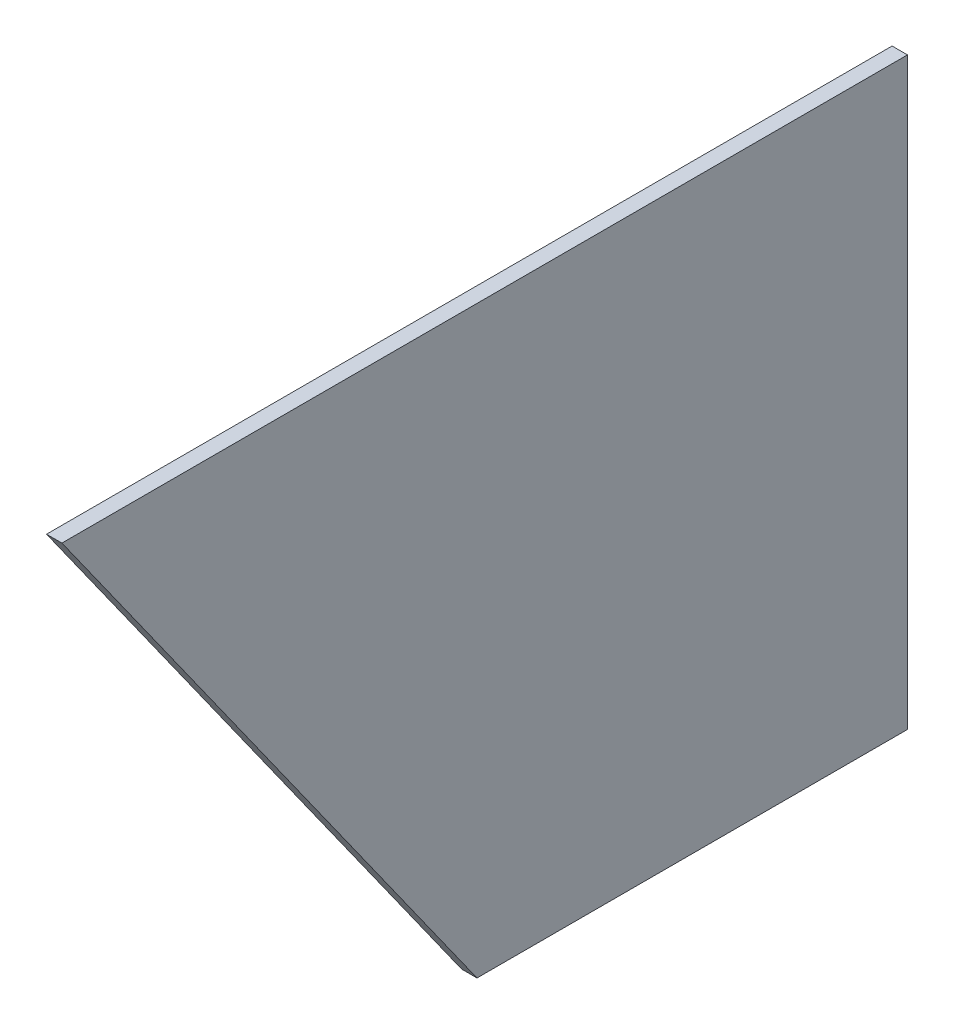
from build123d import *

# Parameters (mm, degrees)
BOSS_EXTRUDE1_DEPTH = 3


with BuildPart() as part:
    # Sketch1 → Boss-Extrude1 (new body)
    with BuildSketch(Plane(origin=(0, 0, 0), x_dir=(0, 0, -1), z_dir=(1, 0, 0))):
        Polygon((-165, 114), (-84, 0), (0, 0), (0, 114), align=None)
    extrude(amount=BOSS_EXTRUDE1_DEPTH)


solid = part.part
